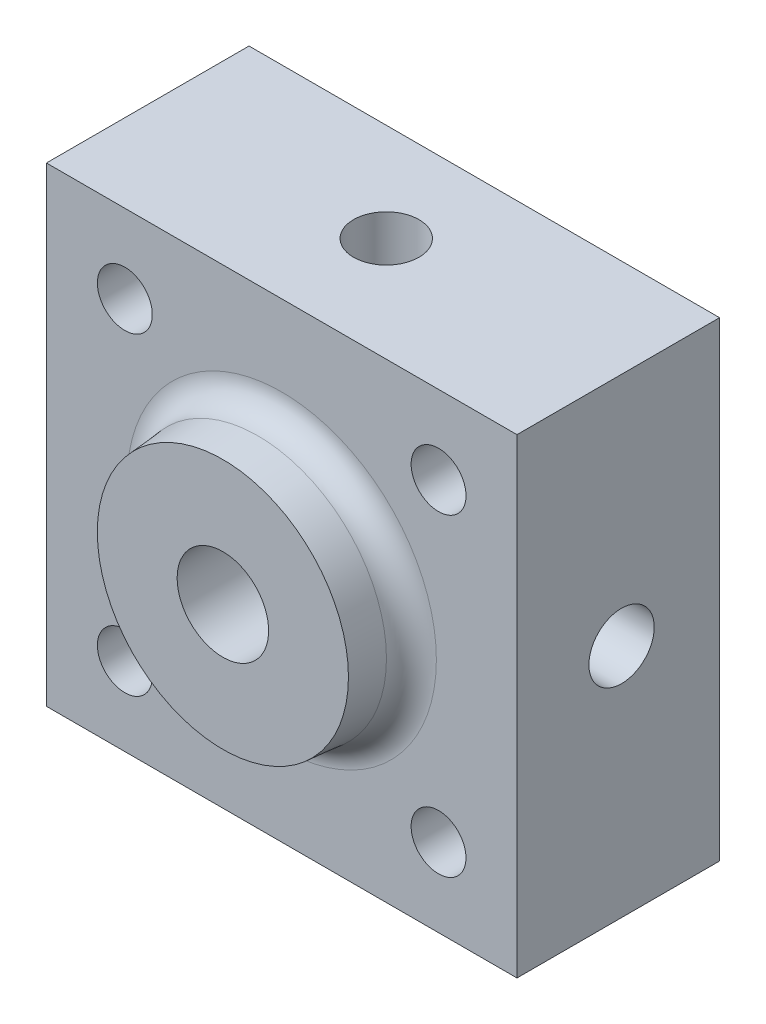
ISO-10303-21;
HEADER;
FILE_DESCRIPTION(('STEP AP214'),'2;1');
FILE_NAME('part.step','',(''),(''),'','','');
FILE_SCHEMA(('AUTOMOTIVE_DESIGN { 1 0 10303 214 1 1 1 1 }'));
ENDSEC;
DATA;
#1=APPLICATION_CONTEXT('core data for automotive mechanical design processes');
#2=APPLICATION_PROTOCOL_DEFINITION('international standard','automotive_design',2000,#1);
#3=PRODUCT_CONTEXT('',#1,'mechanical');
#4=PRODUCT('Part','Part','',(#3));
#5=PRODUCT_RELATED_PRODUCT_CATEGORY('part','',(#4));
#6=PRODUCT_DEFINITION_FORMATION('','',#4);
#7=PRODUCT_DEFINITION_CONTEXT('part definition',#1,'design');
#8=PRODUCT_DEFINITION('design','',#6,#7);
#9=PRODUCT_DEFINITION_SHAPE('','',#8);
#10=(LENGTH_UNIT() NAMED_UNIT(*) SI_UNIT(.MILLI.,.METRE.));
#11=(NAMED_UNIT(*) PLANE_ANGLE_UNIT() SI_UNIT($,.RADIAN.));
#12=(NAMED_UNIT(*) SI_UNIT($,.STERADIAN.) SOLID_ANGLE_UNIT());
#13=UNCERTAINTY_MEASURE_WITH_UNIT(LENGTH_MEASURE(1.E-05),#10,'distance_accuracy_value','');
#14=(GEOMETRIC_REPRESENTATION_CONTEXT(3) GLOBAL_UNCERTAINTY_ASSIGNED_CONTEXT((#13)) GLOBAL_UNIT_ASSIGNED_CONTEXT((#10,
#11,#12)) REPRESENTATION_CONTEXT('',''));
#15=CARTESIAN_POINT('',(0.,0.,0.));
#16=DIRECTION('',(0.,0.,1.));
#17=DIRECTION('',(1.,0.,0.));
#18=AXIS2_PLACEMENT_3D('',#15,#16,#17);
#19=CARTESIAN_POINT('',(-18.,-18.,15.5));
#20=DIRECTION('',(0.,0.,1.));
#21=DIRECTION('',(1.,0.,0.));
#22=AXIS2_PLACEMENT_3D('',#19,#20,#21);
#23=PLANE('',#22);
#24=CARTESIAN_POINT('',(0.,0.,15.5));
#25=DIRECTION('',(0.,0.,1.));
#26=DIRECTION('',(1.,0.,0.));
#27=AXIS2_PLACEMENT_3D('',#24,#25,#26);
#28=CIRCLE('',#27,11.8326623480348);
#29=CARTESIAN_POINT('',(11.8326623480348,0.,15.5));
#30=VERTEX_POINT('',#29);
#31=EDGE_CURVE('E11',#30,#30,#28,.F.);
#32=ORIENTED_EDGE('',*,*,#31,.T.);
#33=EDGE_LOOP('',(#32));
#34=FACE_BOUND('',#33,.T.);
#35=DIRECTION('',(0.,-1.,0.));
#36=VECTOR('',#35,1.);
#37=CARTESIAN_POINT('',(-18.,18.,15.5));
#38=LINE('',#37,#36);
#39=CARTESIAN_POINT('',(-18.,18.,15.5));
#40=VERTEX_POINT('',#39);
#41=CARTESIAN_POINT('',(-18.,-18.,15.5));
#42=VERTEX_POINT('',#41);
#43=EDGE_CURVE('E139',#40,#42,#38,.T.);
#44=ORIENTED_EDGE('',*,*,#43,.T.);
#45=DIRECTION('',(1.,0.,0.));
#46=VECTOR('',#45,1.);
#47=CARTESIAN_POINT('',(-18.,-18.,15.5));
#48=LINE('',#47,#46);
#49=CARTESIAN_POINT('',(18.,-18.,15.5));
#50=VERTEX_POINT('',#49);
#51=EDGE_CURVE('E141',#42,#50,#48,.T.);
#52=ORIENTED_EDGE('',*,*,#51,.T.);
#53=DIRECTION('',(0.,1.,0.));
#54=VECTOR('',#53,1.);
#55=CARTESIAN_POINT('',(18.,18.,15.5));
#56=LINE('',#55,#54);
#57=CARTESIAN_POINT('',(18.,18.,15.5));
#58=VERTEX_POINT('',#57);
#59=EDGE_CURVE('E46',#50,#58,#56,.T.);
#60=ORIENTED_EDGE('',*,*,#59,.T.);
#61=DIRECTION('',(-1.,0.,0.));
#62=VECTOR('',#61,1.);
#63=CARTESIAN_POINT('',(-18.,18.,15.5));
#64=LINE('',#63,#62);
#65=EDGE_CURVE('E41',#58,#40,#64,.T.);
#66=ORIENTED_EDGE('',*,*,#65,.T.);
#67=EDGE_LOOP('',(#44,#52,#60,#66));
#68=FACE_BOUND('',#67,.T.);
#69=CARTESIAN_POINT('',(12.,12.,15.5));
#70=DIRECTION('',(0.,0.,1.));
#71=DIRECTION('',(1.,0.,0.));
#72=AXIS2_PLACEMENT_3D('',#69,#70,#71);
#73=CIRCLE('',#72,2.1);
#74=CARTESIAN_POINT('',(14.1,12.,15.5));
#75=VERTEX_POINT('',#74);
#76=EDGE_CURVE('E124',#75,#75,#73,.T.);
#77=ORIENTED_EDGE('',*,*,#76,.F.);
#78=EDGE_LOOP('',(#77));
#79=FACE_BOUND('',#78,.T.);
#80=CARTESIAN_POINT('',(-12.,12.,15.5));
#81=DIRECTION('',(0.,0.,1.));
#82=DIRECTION('',(-1.,0.,0.));
#83=AXIS2_PLACEMENT_3D('',#80,#81,#82);
#84=CIRCLE('',#83,2.1);
#85=CARTESIAN_POINT('',(-14.1,12.,15.5));
#86=VERTEX_POINT('',#85);
#87=EDGE_CURVE('E118',#86,#86,#84,.T.);
#88=ORIENTED_EDGE('',*,*,#87,.F.);
#89=EDGE_LOOP('',(#88));
#90=FACE_BOUND('',#89,.T.);
#91=CARTESIAN_POINT('',(-12.,-12.,15.5));
#92=DIRECTION('',(0.,0.,1.));
#93=DIRECTION('',(1.,0.,0.));
#94=AXIS2_PLACEMENT_3D('',#91,#92,#93);
#95=CIRCLE('',#94,2.1);
#96=CARTESIAN_POINT('',(-9.9,-12.,15.5));
#97=VERTEX_POINT('',#96);
#98=EDGE_CURVE('E112',#97,#97,#95,.T.);
#99=ORIENTED_EDGE('',*,*,#98,.F.);
#100=EDGE_LOOP('',(#99));
#101=FACE_BOUND('',#100,.T.);
#102=CARTESIAN_POINT('',(12.,-12.,15.5));
#103=DIRECTION('',(0.,0.,1.));
#104=DIRECTION('',(-1.,0.,0.));
#105=AXIS2_PLACEMENT_3D('',#102,#103,#104);
#106=CIRCLE('',#105,2.1);
#107=CARTESIAN_POINT('',(9.9,-12.,15.5));
#108=VERTEX_POINT('',#107);
#109=EDGE_CURVE('E106',#108,#108,#106,.T.);
#110=ORIENTED_EDGE('',*,*,#109,.F.);
#111=EDGE_LOOP('',(#110));
#112=FACE_BOUND('',#111,.T.);
#113=ADVANCED_FACE('F26',(#34,#68,#79,#90,#101,#112),#23,.T.);
#114=CARTESIAN_POINT('',(-18.,18.,15.5));
#115=DIRECTION('',(1.,0.,0.));
#116=DIRECTION('',(0.,1.,0.));
#117=AXIS2_PLACEMENT_3D('',#114,#115,#116);
#118=PLANE('',#117);
#119=CARTESIAN_POINT('',(-17.9999999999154,0.,7.5));
#120=DIRECTION('',(-1.,0.,0.));
#121=DIRECTION('',(0.,0.,1.));
#122=AXIS2_PLACEMENT_3D('',#119,#120,#121);
#123=CIRCLE('',#122,2.5);
#124=CARTESIAN_POINT('',(-17.9999999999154,0.,10.));
#125=VERTEX_POINT('',#124);
#126=EDGE_CURVE('E84',#125,#125,#123,.T.);
#127=ORIENTED_EDGE('',*,*,#126,.F.);
#128=EDGE_LOOP('',(#127));
#129=FACE_BOUND('',#128,.T.);
#130=DIRECTION('',(0.,-1.,0.));
#131=VECTOR('',#130,1.);
#132=CARTESIAN_POINT('',(-18.,18.,0.));
#133=LINE('',#132,#131);
#134=CARTESIAN_POINT('',(-18.,18.,0.));
#135=VERTEX_POINT('',#134);
#136=CARTESIAN_POINT('',(-18.,-18.,0.));
#137=VERTEX_POINT('',#136);
#138=EDGE_CURVE('E130',#135,#137,#133,.T.);
#139=ORIENTED_EDGE('',*,*,#138,.T.);
#140=DIRECTION('',(0.,0.,-1.));
#141=VECTOR('',#140,1.);
#142=CARTESIAN_POINT('',(-18.,-18.,15.5));
#143=LINE('',#142,#141);
#144=EDGE_CURVE('E154',#42,#137,#143,.T.);
#145=ORIENTED_EDGE('',*,*,#144,.F.);
#146=ORIENTED_EDGE('',*,*,#43,.F.);
#147=DIRECTION('',(0.,0.,-1.));
#148=VECTOR('',#147,1.);
#149=CARTESIAN_POINT('',(-18.,18.,15.5));
#150=LINE('',#149,#148);
#151=EDGE_CURVE('E145',#40,#135,#150,.T.);
#152=ORIENTED_EDGE('',*,*,#151,.T.);
#153=EDGE_LOOP('',(#139,#145,#146,#152));
#154=FACE_BOUND('',#153,.T.);
#155=ADVANCED_FACE('F28',(#129,#154),#118,.F.);
#156=CARTESIAN_POINT('',(-18.,-18.,15.5));
#157=DIRECTION('',(0.,1.,0.));
#158=DIRECTION('',(0.,0.,1.));
#159=AXIS2_PLACEMENT_3D('',#156,#157,#158);
#160=PLANE('',#159);
#161=DIRECTION('',(1.,0.,0.));
#162=VECTOR('',#161,1.);
#163=CARTESIAN_POINT('',(-18.,-18.,0.));
#164=LINE('',#163,#162);
#165=CARTESIAN_POINT('',(18.,-18.,0.));
#166=VERTEX_POINT('',#165);
#167=EDGE_CURVE('E133',#137,#166,#164,.T.);
#168=ORIENTED_EDGE('',*,*,#167,.T.);
#169=DIRECTION('',(0.,0.,-1.));
#170=VECTOR('',#169,1.);
#171=CARTESIAN_POINT('',(18.,-18.,15.5));
#172=LINE('',#171,#170);
#173=EDGE_CURVE('E151',#50,#166,#172,.T.);
#174=ORIENTED_EDGE('',*,*,#173,.F.);
#175=ORIENTED_EDGE('',*,*,#51,.F.);
#176=ORIENTED_EDGE('',*,*,#144,.T.);
#177=EDGE_LOOP('',(#168,#174,#175,#176));
#178=FACE_BOUND('',#177,.T.);
#179=ADVANCED_FACE('F186',(#178),#160,.F.);
#180=CARTESIAN_POINT('',(18.,18.,15.5));
#181=DIRECTION('',(-1.,0.,0.));
#182=DIRECTION('',(0.,-1.,0.));
#183=AXIS2_PLACEMENT_3D('',#180,#181,#182);
#184=PLANE('',#183);
#185=CARTESIAN_POINT('',(18.,0.,7.5));
#186=DIRECTION('',(1.,0.,0.));
#187=DIRECTION('',(0.,0.,-1.));
#188=AXIS2_PLACEMENT_3D('',#185,#186,#187);
#189=CIRCLE('',#188,2.5);
#190=CARTESIAN_POINT('',(18.,0.,5.));
#191=VERTEX_POINT('',#190);
#192=EDGE_CURVE('E97',#191,#191,#189,.T.);
#193=ORIENTED_EDGE('',*,*,#192,.F.);
#194=EDGE_LOOP('',(#193));
#195=FACE_BOUND('',#194,.T.);
#196=DIRECTION('',(0.,1.,0.));
#197=VECTOR('',#196,1.);
#198=CARTESIAN_POINT('',(18.,18.,0.));
#199=LINE('',#198,#197);
#200=CARTESIAN_POINT('',(18.,18.,0.));
#201=VERTEX_POINT('',#200);
#202=EDGE_CURVE('E135',#166,#201,#199,.T.);
#203=ORIENTED_EDGE('',*,*,#202,.T.);
#204=DIRECTION('',(0.,0.,-1.));
#205=VECTOR('',#204,1.);
#206=CARTESIAN_POINT('',(18.,18.,15.5));
#207=LINE('',#206,#205);
#208=EDGE_CURVE('E148',#58,#201,#207,.T.);
#209=ORIENTED_EDGE('',*,*,#208,.F.);
#210=ORIENTED_EDGE('',*,*,#59,.F.);
#211=ORIENTED_EDGE('',*,*,#173,.T.);
#212=EDGE_LOOP('',(#203,#209,#210,#211));
#213=FACE_BOUND('',#212,.T.);
#214=ADVANCED_FACE('F195',(#195,#213),#184,.F.);
#215=CARTESIAN_POINT('',(-18.,18.,15.5));
#216=DIRECTION('',(0.,-1.,0.));
#217=DIRECTION('',(0.,0.,-1.));
#218=AXIS2_PLACEMENT_3D('',#215,#216,#217);
#219=PLANE('',#218);
#220=CARTESIAN_POINT('',(0.,17.9999999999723,7.5));
#221=DIRECTION('',(0.,1.,0.));
#222=DIRECTION('',(0.,0.,1.));
#223=AXIS2_PLACEMENT_3D('',#220,#221,#222);
#224=CIRCLE('',#223,2.5);
#225=CARTESIAN_POINT('',(0.,17.9999999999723,10.));
#226=VERTEX_POINT('',#225);
#227=EDGE_CURVE('E85',#226,#226,#224,.T.);
#228=ORIENTED_EDGE('',*,*,#227,.F.);
#229=EDGE_LOOP('',(#228));
#230=FACE_BOUND('',#229,.T.);
#231=DIRECTION('',(-1.,0.,0.));
#232=VECTOR('',#231,1.);
#233=CARTESIAN_POINT('',(-18.,18.,0.));
#234=LINE('',#233,#232);
#235=EDGE_CURVE('E137',#201,#135,#234,.T.);
#236=ORIENTED_EDGE('',*,*,#235,.T.);
#237=ORIENTED_EDGE('',*,*,#151,.F.);
#238=ORIENTED_EDGE('',*,*,#65,.F.);
#239=ORIENTED_EDGE('',*,*,#208,.T.);
#240=EDGE_LOOP('',(#236,#237,#238,#239));
#241=FACE_BOUND('',#240,.T.);
#242=ADVANCED_FACE('F192',(#230,#241),#219,.F.);
#243=CARTESIAN_POINT('',(-18.,-18.,0.));
#244=DIRECTION('',(0.,0.,1.));
#245=DIRECTION('',(1.,0.,0.));
#246=AXIS2_PLACEMENT_3D('',#243,#244,#245);
#247=PLANE('',#246);
#248=CARTESIAN_POINT('',(0.,0.,0.));
#249=DIRECTION('',(0.,0.,-1.));
#250=DIRECTION('',(-1.,0.,0.));
#251=AXIS2_PLACEMENT_3D('',#248,#249,#250);
#252=CIRCLE('',#251,14.5);
#253=CARTESIAN_POINT('',(-14.5,0.,0.));
#254=VERTEX_POINT('',#253);
#255=EDGE_CURVE('E291',#254,#254,#252,.T.);
#256=ORIENTED_EDGE('',*,*,#255,.F.);
#257=EDGE_LOOP('',(#256));
#258=FACE_BOUND('',#257,.T.);
#259=CARTESIAN_POINT('',(12.,-12.,0.));
#260=DIRECTION('',(0.,0.,1.));
#261=DIRECTION('',(-1.,0.,0.));
#262=AXIS2_PLACEMENT_3D('',#259,#260,#261);
#263=CIRCLE('',#262,2.1);
#264=CARTESIAN_POINT('',(9.9,-12.,0.));
#265=VERTEX_POINT('',#264);
#266=EDGE_CURVE('E109',#265,#265,#263,.T.);
#267=ORIENTED_EDGE('',*,*,#266,.T.);
#268=EDGE_LOOP('',(#267));
#269=FACE_BOUND('',#268,.T.);
#270=CARTESIAN_POINT('',(-12.,-12.,0.));
#271=DIRECTION('',(0.,0.,1.));
#272=DIRECTION('',(1.,0.,0.));
#273=AXIS2_PLACEMENT_3D('',#270,#271,#272);
#274=CIRCLE('',#273,2.1);
#275=CARTESIAN_POINT('',(-9.9,-12.,0.));
#276=VERTEX_POINT('',#275);
#277=EDGE_CURVE('E115',#276,#276,#274,.T.);
#278=ORIENTED_EDGE('',*,*,#277,.T.);
#279=EDGE_LOOP('',(#278));
#280=FACE_BOUND('',#279,.T.);
#281=CARTESIAN_POINT('',(-12.,12.,0.));
#282=DIRECTION('',(0.,0.,1.));
#283=DIRECTION('',(-1.,0.,0.));
#284=AXIS2_PLACEMENT_3D('',#281,#282,#283);
#285=CIRCLE('',#284,2.1);
#286=CARTESIAN_POINT('',(-14.1,12.,0.));
#287=VERTEX_POINT('',#286);
#288=EDGE_CURVE('E121',#287,#287,#285,.T.);
#289=ORIENTED_EDGE('',*,*,#288,.T.);
#290=EDGE_LOOP('',(#289));
#291=FACE_BOUND('',#290,.T.);
#292=CARTESIAN_POINT('',(12.,12.,0.));
#293=DIRECTION('',(0.,0.,1.));
#294=DIRECTION('',(1.,0.,0.));
#295=AXIS2_PLACEMENT_3D('',#292,#293,#294);
#296=CIRCLE('',#295,2.1);
#297=CARTESIAN_POINT('',(14.1,12.,0.));
#298=VERTEX_POINT('',#297);
#299=EDGE_CURVE('E127',#298,#298,#296,.T.);
#300=ORIENTED_EDGE('',*,*,#299,.T.);
#301=EDGE_LOOP('',(#300));
#302=FACE_BOUND('',#301,.T.);
#303=ORIENTED_EDGE('',*,*,#138,.F.);
#304=ORIENTED_EDGE('',*,*,#235,.F.);
#305=ORIENTED_EDGE('',*,*,#202,.F.);
#306=ORIENTED_EDGE('',*,*,#167,.F.);
#307=EDGE_LOOP('',(#303,#304,#305,#306));
#308=FACE_BOUND('',#307,.T.);
#309=ADVANCED_FACE('F190',(#258,#269,#280,#291,#302,#308),#247,.F.);
#310=CARTESIAN_POINT('',(12.,12.,0.));
#311=DIRECTION('',(0.,0.,1.));
#312=DIRECTION('',(1.,0.,0.));
#313=AXIS2_PLACEMENT_3D('',#310,#311,#312);
#314=CYLINDRICAL_SURFACE('',#313,2.1);
#315=ORIENTED_EDGE('',*,*,#299,.F.);
#316=EDGE_LOOP('',(#315));
#317=FACE_BOUND('',#316,.T.);
#318=ORIENTED_EDGE('',*,*,#76,.T.);
#319=EDGE_LOOP('',(#318));
#320=FACE_BOUND('',#319,.T.);
#321=ADVANCED_FACE('F240',(#317,#320),#314,.F.);
#322=CARTESIAN_POINT('',(-12.,12.,0.));
#323=DIRECTION('',(0.,0.,1.));
#324=DIRECTION('',(1.,0.,0.));
#325=AXIS2_PLACEMENT_3D('',#322,#323,#324);
#326=CYLINDRICAL_SURFACE('',#325,2.1);
#327=ORIENTED_EDGE('',*,*,#288,.F.);
#328=EDGE_LOOP('',(#327));
#329=FACE_BOUND('',#328,.T.);
#330=ORIENTED_EDGE('',*,*,#87,.T.);
#331=EDGE_LOOP('',(#330));
#332=FACE_BOUND('',#331,.T.);
#333=ADVANCED_FACE('F234',(#329,#332),#326,.F.);
#334=CARTESIAN_POINT('',(-12.,-12.,0.));
#335=DIRECTION('',(0.,0.,1.));
#336=DIRECTION('',(1.,0.,0.));
#337=AXIS2_PLACEMENT_3D('',#334,#335,#336);
#338=CYLINDRICAL_SURFACE('',#337,2.1);
#339=ORIENTED_EDGE('',*,*,#277,.F.);
#340=EDGE_LOOP('',(#339));
#341=FACE_BOUND('',#340,.T.);
#342=ORIENTED_EDGE('',*,*,#98,.T.);
#343=EDGE_LOOP('',(#342));
#344=FACE_BOUND('',#343,.T.);
#345=ADVANCED_FACE('F225',(#341,#344),#338,.F.);
#346=CARTESIAN_POINT('',(12.,-12.,0.));
#347=DIRECTION('',(0.,0.,1.));
#348=DIRECTION('',(1.,0.,0.));
#349=AXIS2_PLACEMENT_3D('',#346,#347,#348);
#350=CYLINDRICAL_SURFACE('',#349,2.1);
#351=ORIENTED_EDGE('',*,*,#266,.F.);
#352=EDGE_LOOP('',(#351));
#353=FACE_BOUND('',#352,.T.);
#354=ORIENTED_EDGE('',*,*,#109,.T.);
#355=EDGE_LOOP('',(#354));
#356=FACE_BOUND('',#355,.T.);
#357=ADVANCED_FACE('F224',(#353,#356),#350,.F.);
#358=CARTESIAN_POINT('',(0.,0.,15.5));
#359=DIRECTION('',(0.,0.,-1.));
#360=DIRECTION('',(1.,0.,0.));
#361=AXIS2_PLACEMENT_3D('',#358,#359,#360);
#362=CONICAL_SURFACE('',#361,10.,0.0872664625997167);
#363=CARTESIAN_POINT('',(0.,0.,17.3256885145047));
#364=DIRECTION('',(0.,0.,1.));
#365=DIRECTION('',(1.,0.,0.));
#366=AXIS2_PLACEMENT_3D('',#363,#364,#365);
#367=CIRCLE('',#366,9.84027295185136);
#368=CARTESIAN_POINT('',(9.84027295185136,0.,17.3256885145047));
#369=VERTEX_POINT('',#368);
#370=EDGE_CURVE('E34',#369,#369,#367,.T.);
#371=ORIENTED_EDGE('',*,*,#370,.T.);
#372=EDGE_LOOP('',(#371));
#373=FACE_BOUND('',#372,.T.);
#374=CARTESIAN_POINT('',(0.,0.,20.));
#375=DIRECTION('',(0.,0.,1.));
#376=DIRECTION('',(1.,0.,0.));
#377=AXIS2_PLACEMENT_3D('',#374,#375,#376);
#378=CIRCLE('',#377,9.60630101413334);
#379=CARTESIAN_POINT('',(9.60630101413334,0.,20.));
#380=VERTEX_POINT('',#379);
#381=EDGE_CURVE('E103',#380,#380,#378,.T.);
#382=ORIENTED_EDGE('',*,*,#381,.F.);
#383=EDGE_LOOP('',(#382));
#384=FACE_BOUND('',#383,.T.);
#385=ADVANCED_FACE('F159',(#373,#384),#362,.T.);
#386=CARTESIAN_POINT('',(0.,0.,20.));
#387=DIRECTION('',(0.,0.,1.));
#388=DIRECTION('',(1.,0.,0.));
#389=AXIS2_PLACEMENT_3D('',#386,#387,#388);
#390=PLANE('',#389);
#391=CARTESIAN_POINT('',(0.,0.,20.));
#392=DIRECTION('',(0.,0.,-1.));
#393=DIRECTION('',(-1.,0.,0.));
#394=AXIS2_PLACEMENT_3D('',#391,#392,#393);
#395=CIRCLE('',#394,3.5);
#396=CARTESIAN_POINT('',(-3.5,0.,20.));
#397=VERTEX_POINT('',#396);
#398=EDGE_CURVE('E359',#397,#397,#395,.T.);
#399=ORIENTED_EDGE('',*,*,#398,.T.);
#400=EDGE_LOOP('',(#399));
#401=FACE_BOUND('',#400,.T.);
#402=ORIENTED_EDGE('',*,*,#381,.T.);
#403=EDGE_LOOP('',(#402));
#404=FACE_BOUND('',#403,.T.);
#405=ADVANCED_FACE('F165',(#401,#404),#390,.T.);
#406=CARTESIAN_POINT('',(0.,0.,17.5));
#407=DIRECTION('',(0.,0.,1.));
#408=DIRECTION('',(1.,0.,0.));
#409=AXIS2_PLACEMENT_3D('',#406,#407,#408);
#410=TOROIDAL_SURFACE('',#409,11.8326623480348,2.);
#411=ORIENTED_EDGE('',*,*,#31,.F.);
#412=EDGE_LOOP('',(#411));
#413=FACE_BOUND('',#412,.T.);
#414=ORIENTED_EDGE('',*,*,#370,.F.);
#415=EDGE_LOOP('',(#414));
#416=FACE_BOUND('',#415,.T.);
#417=ADVANCED_FACE('F162',(#413,#416),#410,.F.);
#418=CARTESIAN_POINT('',(8.,0.,7.5));
#419=DIRECTION('',(1.,0.,0.));
#420=DIRECTION('',(0.,0.,-1.));
#421=AXIS2_PLACEMENT_3D('',#418,#419,#420);
#422=CONICAL_SURFACE('',#421,2.5,1.02974425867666);
#423=CARTESIAN_POINT('',(6.49784845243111,0.,7.5));
#424=VERTEX_POINT('',#423);
#425=VERTEX_LOOP('',#424);
#426=FACE_BOUND('',#425,.T.);
#427=CARTESIAN_POINT('',(8.,0.,7.5));
#428=DIRECTION('',(1.,0.,0.));
#429=DIRECTION('',(0.,0.,-1.));
#430=AXIS2_PLACEMENT_3D('',#427,#428,#429);
#431=CIRCLE('',#430,2.5);
#432=CARTESIAN_POINT('',(8.,0.,5.));
#433=VERTEX_POINT('',#432);
#434=EDGE_CURVE('E100',#433,#433,#431,.T.);
#435=ORIENTED_EDGE('',*,*,#434,.T.);
#436=EDGE_LOOP('',(#435));
#437=FACE_BOUND('',#436,.T.);
#438=ADVANCED_FACE('F164',(#426,#437),#422,.F.);
#439=CARTESIAN_POINT('',(18.,0.,7.5));
#440=DIRECTION('',(1.,0.,0.));
#441=DIRECTION('',(0.,0.,-1.));
#442=AXIS2_PLACEMENT_3D('',#439,#440,#441);
#443=CYLINDRICAL_SURFACE('',#442,2.5);
#444=ORIENTED_EDGE('',*,*,#434,.F.);
#445=EDGE_LOOP('',(#444));
#446=FACE_BOUND('',#445,.T.);
#447=ORIENTED_EDGE('',*,*,#192,.T.);
#448=EDGE_LOOP('',(#447));
#449=FACE_BOUND('',#448,.T.);
#450=ADVANCED_FACE('F172',(#446,#449),#443,.F.);
#451=CARTESIAN_POINT('',(-7.99999999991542,0.,7.5));
#452=DIRECTION('',(-1.,0.,0.));
#453=DIRECTION('',(0.,0.,1.));
#454=AXIS2_PLACEMENT_3D('',#451,#452,#453);
#455=CONICAL_SURFACE('',#454,2.5,1.02974425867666);
#456=CARTESIAN_POINT('',(-6.49784845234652,0.,7.5));
#457=VERTEX_POINT('',#456);
#458=VERTEX_LOOP('',#457);
#459=FACE_BOUND('',#458,.T.);
#460=CARTESIAN_POINT('',(-7.99999999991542,0.,7.5));
#461=DIRECTION('',(-1.,0.,0.));
#462=DIRECTION('',(0.,0.,1.));
#463=AXIS2_PLACEMENT_3D('',#460,#461,#462);
#464=CIRCLE('',#463,2.5);
#465=CARTESIAN_POINT('',(-7.99999999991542,0.,10.));
#466=VERTEX_POINT('',#465);
#467=EDGE_CURVE('E88',#466,#466,#464,.T.);
#468=ORIENTED_EDGE('',*,*,#467,.T.);
#469=EDGE_LOOP('',(#468));
#470=FACE_BOUND('',#469,.T.);
#471=ADVANCED_FACE('F333',(#459,#470),#455,.F.);
#472=CARTESIAN_POINT('',(-17.9999999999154,0.,7.5));
#473=DIRECTION('',(-1.,0.,0.));
#474=DIRECTION('',(0.,0.,1.));
#475=AXIS2_PLACEMENT_3D('',#472,#473,#474);
#476=CYLINDRICAL_SURFACE('',#475,2.5);
#477=ORIENTED_EDGE('',*,*,#467,.F.);
#478=EDGE_LOOP('',(#477));
#479=FACE_BOUND('',#478,.T.);
#480=ORIENTED_EDGE('',*,*,#126,.T.);
#481=EDGE_LOOP('',(#480));
#482=FACE_BOUND('',#481,.T.);
#483=ADVANCED_FACE('F78',(#479,#482),#476,.F.);
#484=CARTESIAN_POINT('',(0.,7.99999999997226,7.5));
#485=DIRECTION('',(0.,1.,0.));
#486=DIRECTION('',(0.,0.,1.));
#487=AXIS2_PLACEMENT_3D('',#484,#485,#486);
#488=CONICAL_SURFACE('',#487,2.5,1.02974425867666);
#489=CARTESIAN_POINT('',(0.,6.49784845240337,7.5));
#490=VERTEX_POINT('',#489);
#491=VERTEX_LOOP('',#490);
#492=FACE_BOUND('',#491,.T.);
#493=CARTESIAN_POINT('',(0.,7.99999999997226,7.5));
#494=DIRECTION('',(0.,1.,0.));
#495=DIRECTION('',(0.,0.,1.));
#496=AXIS2_PLACEMENT_3D('',#493,#494,#495);
#497=CIRCLE('',#496,2.5);
#498=CARTESIAN_POINT('',(0.,7.99999999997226,10.));
#499=VERTEX_POINT('',#498);
#500=EDGE_CURVE('E82',#499,#499,#497,.T.);
#501=ORIENTED_EDGE('',*,*,#500,.T.);
#502=EDGE_LOOP('',(#501));
#503=FACE_BOUND('',#502,.T.);
#504=ADVANCED_FACE('F74',(#492,#503),#488,.F.);
#505=CARTESIAN_POINT('',(0.,17.9999999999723,7.5));
#506=DIRECTION('',(0.,1.,0.));
#507=DIRECTION('',(0.,0.,1.));
#508=AXIS2_PLACEMENT_3D('',#505,#506,#507);
#509=CYLINDRICAL_SURFACE('',#508,2.5);
#510=CARTESIAN_POINT('',(-1.5,10.,5.5));
#511=CARTESIAN_POINT('',(-1.50000404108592,10.0754789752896,5.50000583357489));
#512=CARTESIAN_POINT('',(-1.49426852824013,10.1509384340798,5.49566366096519));
#513=CARTESIAN_POINT('',(-1.47174965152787,10.2993239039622,5.47907409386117));
#514=CARTESIAN_POINT('',(-1.45495475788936,10.3722471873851,5.46681844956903));
#515=CARTESIAN_POINT('',(-1.41143486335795,10.5130836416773,5.4363766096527));
#516=CARTESIAN_POINT('',(-1.3847815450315,10.5810288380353,5.4182333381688));
#517=CARTESIAN_POINT('',(-1.32252909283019,10.7114374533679,5.37814095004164));
#518=CARTESIAN_POINT('',(-1.28692729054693,10.7738992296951,5.35619069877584));
#519=CARTESIAN_POINT('',(-1.20271292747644,10.8999490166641,5.30771405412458));
#520=CARTESIAN_POINT('',(-1.15304179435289,10.9627409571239,5.28095628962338));
#521=CARTESIAN_POINT('',(-1.04426801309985,11.0797647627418,5.22773770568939));
#522=CARTESIAN_POINT('',(-0.985158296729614,11.1339901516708,5.20127712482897));
#523=CARTESIAN_POINT('',(-0.851442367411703,11.2381338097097,5.14824432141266));
#524=CARTESIAN_POINT('',(-0.77585199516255,11.2869544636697,5.12196866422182));
#525=CARTESIAN_POINT('',(-0.61565422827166,11.3708097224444,5.07556213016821));
#526=CARTESIAN_POINT('',(-0.531055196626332,11.4058569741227,5.05542562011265));
#527=CARTESIAN_POINT('',(-0.363771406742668,11.4575959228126,5.0252901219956));
#528=CARTESIAN_POINT('',(-0.281674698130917,11.4757203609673,5.0145069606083));
#529=CARTESIAN_POINT('',(-0.11497050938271,11.4979428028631,5.00125060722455));
#530=CARTESIAN_POINT('',(-0.0303654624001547,11.5020539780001,4.99876961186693));
#531=CARTESIAN_POINT('',(0.127637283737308,11.4963862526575,5.00216627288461));
#532=CARTESIAN_POINT('',(0.201123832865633,11.4882664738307,5.00704562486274));
#533=CARTESIAN_POINT('',(0.345464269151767,11.4615202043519,5.02292002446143));
#534=CARTESIAN_POINT('',(0.4163179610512,11.4428929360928,5.03391552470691));
#535=CARTESIAN_POINT('',(0.554056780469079,11.3958344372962,5.06115092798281));
#536=CARTESIAN_POINT('',(0.620916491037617,11.367346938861,5.07742089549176));
#537=CARTESIAN_POINT('',(0.74898866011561,11.3016153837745,5.11390362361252));
#538=CARTESIAN_POINT('',(0.81019964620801,11.264369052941,5.13411740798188));
#539=CARTESIAN_POINT('',(0.933074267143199,11.1771609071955,5.17962074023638));
#540=CARTESIAN_POINT('',(0.993918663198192,11.1262116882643,5.2052281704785));
#541=CARTESIAN_POINT('',(1.10671465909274,11.0155958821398,5.25744445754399));
#542=CARTESIAN_POINT('',(1.1586540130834,10.9559174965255,5.28405463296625));
#543=CARTESIAN_POINT('',(1.25824837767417,10.8213465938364,5.33888924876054));
#544=CARTESIAN_POINT('',(1.30470933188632,10.7454924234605,5.36694338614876));
#545=CARTESIAN_POINT('',(1.38397217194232,10.5852937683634,5.41749120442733));
#546=CARTESIAN_POINT('',(1.41679921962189,10.5009652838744,5.43999509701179));
#547=CARTESIAN_POINT('',(1.46077497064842,10.3476063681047,5.47104134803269));
#548=CARTESIAN_POINT('',(1.47527903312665,10.2799593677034,5.48166111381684));
#549=CARTESIAN_POINT('',(1.49480872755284,10.1426263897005,5.49607849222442));
#550=CARTESIAN_POINT('',(1.49984538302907,10.0729428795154,5.49988403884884));
#551=CARTESIAN_POINT('',(1.50014781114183,9.9334483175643,5.50011085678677));
#552=CARTESIAN_POINT('',(1.49540004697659,9.86363722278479,5.49652189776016));
#553=CARTESIAN_POINT('',(1.47640290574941,9.72601265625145,5.48248479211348));
#554=CARTESIAN_POINT('',(1.4621460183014,9.65820080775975,5.47203122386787));
#555=CARTESIAN_POINT('',(1.42488312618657,9.52628542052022,5.445682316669));
#556=CARTESIAN_POINT('',(1.40188805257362,9.46217736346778,5.42979377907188));
#557=CARTESIAN_POINT('',(1.34796261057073,9.33852228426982,5.39428460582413));
#558=CARTESIAN_POINT('',(1.31702924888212,9.278976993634,5.37466256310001));
#559=CARTESIAN_POINT('',(1.24167439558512,9.15475991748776,5.32963180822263));
#560=CARTESIAN_POINT('',(1.19582663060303,9.09109916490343,5.30381760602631));
#561=CARTESIAN_POINT('',(1.09487395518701,8.97171451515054,5.2517824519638));
#562=CARTESIAN_POINT('',(1.03976018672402,8.91599830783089,5.22556113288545));
#563=CARTESIAN_POINT('',(0.913274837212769,8.80677599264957,5.17164374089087));
#564=CARTESIAN_POINT('',(0.840721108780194,8.75449927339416,5.1441992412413));
#565=CARTESIAN_POINT('',(0.686103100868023,8.66309722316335,5.09462360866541));
#566=CARTESIAN_POINT('',(0.604045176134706,8.62396317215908,5.07248895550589));
#567=CARTESIAN_POINT('',(0.438840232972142,8.56313179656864,5.03747719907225));
#568=CARTESIAN_POINT('',(0.356205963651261,8.54037377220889,5.02404411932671));
#569=CARTESIAN_POINT('',(0.18738306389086,8.50928539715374,5.005592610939));
#570=CARTESIAN_POINT('',(0.101198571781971,8.50093870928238,5.00056465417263));
#571=CARTESIAN_POINT('',(-0.0598120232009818,8.49932539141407,4.99959399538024));
#572=CARTESIAN_POINT('',(-0.134620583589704,8.50419666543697,5.00252942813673));
#573=CARTESIAN_POINT('',(-0.282148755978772,8.52489382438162,5.01487051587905));
#574=CARTESIAN_POINT('',(-0.354868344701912,8.5407198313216,5.02427624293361));
#575=CARTESIAN_POINT('',(-0.495145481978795,8.58221957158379,5.04850572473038));
#576=CARTESIAN_POINT('',(-0.562767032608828,8.60773159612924,5.06324033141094));
#577=CARTESIAN_POINT('',(-0.692781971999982,8.66764059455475,5.09696662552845));
#578=CARTESIAN_POINT('',(-0.75517418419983,8.7020395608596,5.11595926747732));
#579=CARTESIAN_POINT('',(-0.880263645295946,8.78292519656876,5.15906567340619));
#580=CARTESIAN_POINT('',(-0.942258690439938,8.83031870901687,5.18351155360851));
#581=CARTESIAN_POINT('',(-1.05789751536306,8.93375303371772,5.23398092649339));
#582=CARTESIAN_POINT('',(-1.11153190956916,8.98980342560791,5.26000614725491));
#583=CARTESIAN_POINT('',(-1.2159097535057,9.1172855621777,5.31471834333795));
#584=CARTESIAN_POINT('',(-1.26542406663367,9.1897664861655,5.34332433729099));
#585=CARTESIAN_POINT('',(-1.35156817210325,9.34348485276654,5.39623535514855));
#586=CARTESIAN_POINT('',(-1.38820466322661,9.42471771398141,5.42054261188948));
#587=CARTESIAN_POINT('',(-1.44437116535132,9.5870642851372,5.4591999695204));
#588=CARTESIAN_POINT('',(-1.46509526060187,9.66759523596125,5.47422334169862));
#589=CARTESIAN_POINT('',(-1.49289268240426,9.83209739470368,5.49460967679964));
#590=CARTESIAN_POINT('',(-1.49999550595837,9.91606076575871,5.49999351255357));
#591=CARTESIAN_POINT('',(-1.5,10.,5.5));
#592=B_SPLINE_CURVE_WITH_KNOTS('',3,(#510,#511,#512,#513,#514,#515,#516,#517,#518,#519,#520,
#521,#522,#523,#524,#525,#526,#527,#528,#529,#530,#531,#532,#533,#534,#535,#536,#537,#538,#539,
#540,#541,#542,#543,#544,#545,#546,#547,#548,#549,#550,#551,#552,#553,#554,#555,#556,#557,#558,
#559,#560,#561,#562,#563,#564,#565,#566,#567,#568,#569,#570,#571,#572,#573,#574,#575,#576,#577,
#578,#579,#580,#581,#582,#583,#584,#585,#586,#587,#588,#589,#590,#591),.UNSPECIFIED.,.T.,.F.,(4,
2,2,2,2,2,2,2,2,2,2,2,2,2,2,2,2,2,2,2,2,2,2,2,2,2,2,2,2,2,2,2,2,2,2,2,2,2,2,2,4),(0.,
0.22608524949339,0.452406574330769,0.677113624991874,0.901887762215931,1.15414462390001,
1.40659128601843,1.68630157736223,1.9657544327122,2.21853330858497,2.47107452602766,
2.69230130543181,2.91354445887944,3.13607155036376,3.35865648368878,3.60782810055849,
3.85733966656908,4.13576671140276,4.41367760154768,4.62276298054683,4.83160475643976,
5.04073566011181,5.25003193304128,5.45906724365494,5.6681814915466,5.91499438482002,
6.16204457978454,6.44121828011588,6.72020638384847,6.97891479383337,7.23732973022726,
7.46129321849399,7.68525920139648,7.90563970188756,8.12606965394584,8.37042963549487,
8.61506198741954,8.89071695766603,9.16622832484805,9.41820120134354,9.66962780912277),.UNSPECIFIED.);
#593=CARTESIAN_POINT('',(-1.5,10.,5.5));
#594=VERTEX_POINT('',#593);
#595=EDGE_CURVE('E294',#594,#594,#592,.T.);
#596=ORIENTED_EDGE('',*,*,#595,.T.);
#597=EDGE_LOOP('',(#596));
#598=FACE_BOUND('',#597,.T.);
#599=ORIENTED_EDGE('',*,*,#500,.F.);
#600=EDGE_LOOP('',(#599));
#601=FACE_BOUND('',#600,.T.);
#602=ORIENTED_EDGE('',*,*,#227,.T.);
#603=EDGE_LOOP('',(#602));
#604=FACE_BOUND('',#603,.T.);
#605=ADVANCED_FACE('F77',(#598,#601,#604),#509,.F.);
#606=CARTESIAN_POINT('',(0.,0.,-6.40280803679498));
#607=DIRECTION('',(0.,0.,-1.));
#608=DIRECTION('',(-1.,0.,0.));
#609=AXIS2_PLACEMENT_3D('',#606,#607,#608);
#610=CYLINDRICAL_SURFACE('',#609,13.);
#611=CARTESIAN_POINT('',(0.,0.,0.));
#612=DIRECTION('',(0.,0.,-1.));
#613=DIRECTION('',(-1.,0.,0.));
#614=AXIS2_PLACEMENT_3D('',#611,#612,#613);
#615=CIRCLE('',#614,13.);
#616=CARTESIAN_POINT('',(-13.,0.,0.));
#617=VERTEX_POINT('',#616);
#618=EDGE_CURVE('E91',#617,#617,#615,.T.);
#619=ORIENTED_EDGE('',*,*,#618,.F.);
#620=EDGE_LOOP('',(#619));
#621=FACE_BOUND('',#620,.T.);
#622=CARTESIAN_POINT('',(0.,0.,3.));
#623=DIRECTION('',(0.,0.,-1.));
#624=DIRECTION('',(-1.,0.,0.));
#625=AXIS2_PLACEMENT_3D('',#622,#623,#624);
#626=CIRCLE('',#625,13.);
#627=CARTESIAN_POINT('',(-13.,0.,3.));
#628=VERTEX_POINT('',#627);
#629=EDGE_CURVE('E284',#628,#628,#626,.T.);
#630=ORIENTED_EDGE('',*,*,#629,.T.);
#631=EDGE_LOOP('',(#630));
#632=FACE_BOUND('',#631,.T.);
#633=ADVANCED_FACE('F307',(#621,#632),#610,.T.);
#634=CARTESIAN_POINT('',(0.,14.5,3.));
#635=DIRECTION('',(0.,0.,1.));
#636=DIRECTION('',(1.,0.,0.));
#637=AXIS2_PLACEMENT_3D('',#634,#635,#636);
#638=PLANE('',#637);
#639=ORIENTED_EDGE('',*,*,#629,.F.);
#640=EDGE_LOOP('',(#639));
#641=FACE_BOUND('',#640,.T.);
#642=CARTESIAN_POINT('',(0.,0.,3.));
#643=DIRECTION('',(0.,0.,-1.));
#644=DIRECTION('',(-1.,0.,0.));
#645=AXIS2_PLACEMENT_3D('',#642,#643,#644);
#646=CIRCLE('',#645,14.5);
#647=CARTESIAN_POINT('',(-14.5,0.,3.));
#648=VERTEX_POINT('',#647);
#649=EDGE_CURVE('E286',#648,#648,#646,.T.);
#650=ORIENTED_EDGE('',*,*,#649,.T.);
#651=EDGE_LOOP('',(#650));
#652=FACE_BOUND('',#651,.T.);
#653=ADVANCED_FACE('F270',(#641,#652),#638,.F.);
#654=CARTESIAN_POINT('',(0.,0.,-6.40280803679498));
#655=DIRECTION('',(0.,0.,-1.));
#656=DIRECTION('',(-1.,0.,0.));
#657=AXIS2_PLACEMENT_3D('',#654,#655,#656);
#658=CYLINDRICAL_SURFACE('',#657,14.5);
#659=ORIENTED_EDGE('',*,*,#649,.F.);
#660=EDGE_LOOP('',(#659));
#661=FACE_BOUND('',#660,.T.);
#662=ORIENTED_EDGE('',*,*,#255,.T.);
#663=EDGE_LOOP('',(#662));
#664=FACE_BOUND('',#663,.T.);
#665=ADVANCED_FACE('F260',(#661,#664),#658,.F.);
#666=CARTESIAN_POINT('',(0.,0.,0.));
#667=DIRECTION('',(0.,0.,-1.));
#668=DIRECTION('',(-1.,0.,0.));
#669=AXIS2_PLACEMENT_3D('',#666,#667,#668);
#670=CIRCLE('',#669,3.5);
#671=CARTESIAN_POINT('',(-3.5,0.,0.));
#672=VERTEX_POINT('',#671);
#673=EDGE_CURVE('E276',#672,#672,#670,.T.);
#674=ORIENTED_EDGE('',*,*,#673,.F.);
#675=EDGE_LOOP('',(#674));
#676=FACE_BOUND('',#675,.T.);
#677=CARTESIAN_POINT('',(0.,10.,0.));
#678=DIRECTION('',(0.,0.,-1.));
#679=DIRECTION('',(-1.,0.,0.));
#680=AXIS2_PLACEMENT_3D('',#677,#678,#679);
#681=CIRCLE('',#680,1.5);
#682=CARTESIAN_POINT('',(-1.5,10.,0.));
#683=VERTEX_POINT('',#682);
#684=EDGE_CURVE('E280',#683,#683,#681,.T.);
#685=ORIENTED_EDGE('',*,*,#684,.F.);
#686=EDGE_LOOP('',(#685));
#687=FACE_BOUND('',#686,.T.);
#688=ORIENTED_EDGE('',*,*,#618,.T.);
#689=EDGE_LOOP('',(#688));
#690=FACE_BOUND('',#689,.T.);
#691=ADVANCED_FACE('F249',(#676,#687,#690),#247,.F.);
#692=CARTESIAN_POINT('',(0.,10.,8.5));
#693=DIRECTION('',(0.,0.,-1.));
#694=DIRECTION('',(-1.,0.,0.));
#695=AXIS2_PLACEMENT_3D('',#692,#693,#694);
#696=CYLINDRICAL_SURFACE('',#695,1.5);
#697=ORIENTED_EDGE('',*,*,#684,.T.);
#698=EDGE_LOOP('',(#697));
#699=FACE_BOUND('',#698,.T.);
#700=ORIENTED_EDGE('',*,*,#595,.F.);
#701=EDGE_LOOP('',(#700));
#702=FACE_BOUND('',#701,.T.);
#703=ADVANCED_FACE('F259',(#699,#702),#696,.F.);
#704=CARTESIAN_POINT('',(0.,0.,20.));
#705=DIRECTION('',(0.,0.,-1.));
#706=DIRECTION('',(-1.,0.,0.));
#707=AXIS2_PLACEMENT_3D('',#704,#705,#706);
#708=CYLINDRICAL_SURFACE('',#707,3.5);
#709=ORIENTED_EDGE('',*,*,#398,.F.);
#710=EDGE_LOOP('',(#709));
#711=FACE_BOUND('',#710,.T.);
#712=ORIENTED_EDGE('',*,*,#673,.T.);
#713=EDGE_LOOP('',(#712));
#714=FACE_BOUND('',#713,.T.);
#715=ADVANCED_FACE('F266',(#711,#714),#708,.F.);
#716=CLOSED_SHELL('',(#113,#155,#179,#214,#242,#309,#321,#333,#345,#357,#385,#405,#417,#438,
#450,#471,#483,#504,#605,#633,#653,#665,#691,#703,#715));
#717=MANIFOLD_SOLID_BREP('B2',#716);
#718=ADVANCED_BREP_SHAPE_REPRESENTATION('',(#18,#717),#14);
#719=SHAPE_DEFINITION_REPRESENTATION(#9,#718);
ENDSEC;
END-ISO-10303-21;
